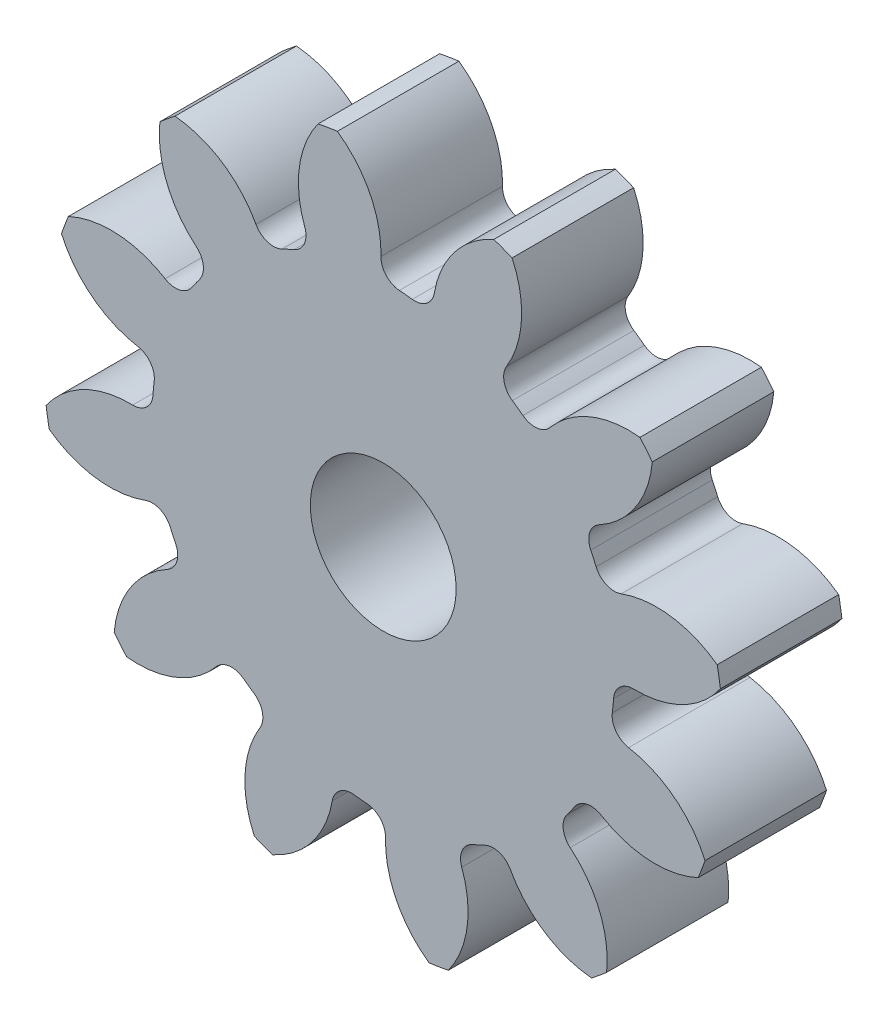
from build123d import *

# Parameters (mm, degrees)
SKETCH3_R         = 355.6
GEARBODY_DEPTH    = 127
TOOTHCUT_DEPTH    = 519.682677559
CIRPATTERN1_COUNT = 12
BOREDIA_R         = 76.2
BORE_DEPTH        = 12700


with BuildPart() as part:
    # Sketch3 → gearBody (new body)
    with BuildSketch(Plane.XY):
        Circle(SKETCH3_R)
    extrude(amount=GEARBODY_DEPTH)

    # Sketch2 → toothCut (cut, through all)
    with BuildSketch(Plane.XY):
        with BuildLine():
            ThreePointArc((239.385752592, -30.333998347), (240.143219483, -23.599240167), (240.711251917, -16.845865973))
            ThreePointArc((240.711251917, -16.845865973), (247.431097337, -2.988217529), (261.866407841, 2.379515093))
            ThreePointArc((261.866407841, 2.379515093), (315.427747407, 15.142850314), (355.6, 52.797995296))
            ThreePointArc((355.6, 52.797995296), (357.774828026, -35.159077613), (338.519605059, -121.010186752))
            ThreePointArc((338.519605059, -121.010186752), (306.445909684, -76.255322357), (256.393740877, -53.309729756))
            ThreePointArc((256.393740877, -53.309729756), (243.279475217, -45.234658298), (239.385752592, -30.333998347))
        make_face()
    toothcut = extrude(amount=TOOTHCUT_DEPTH, mode=Mode.SUBTRACT)

    # CirPattern1: toothCut ×12 about axis
    cirpattern1_axis = Axis((0, 0, 0), (0, 0, 1))
    for i in range(1, CIRPATTERN1_COUNT):
        add(toothcut.rotate(cirpattern1_axis, i * 360 / CIRPATTERN1_COUNT), mode=Mode.SUBTRACT)

    # boreDia → bore (cut, symmetric)
    with BuildSketch(Plane.XY):
        Circle(BOREDIA_R)
    extrude(amount=BORE_DEPTH, both=True, mode=Mode.SUBTRACT)


solid = part.part
